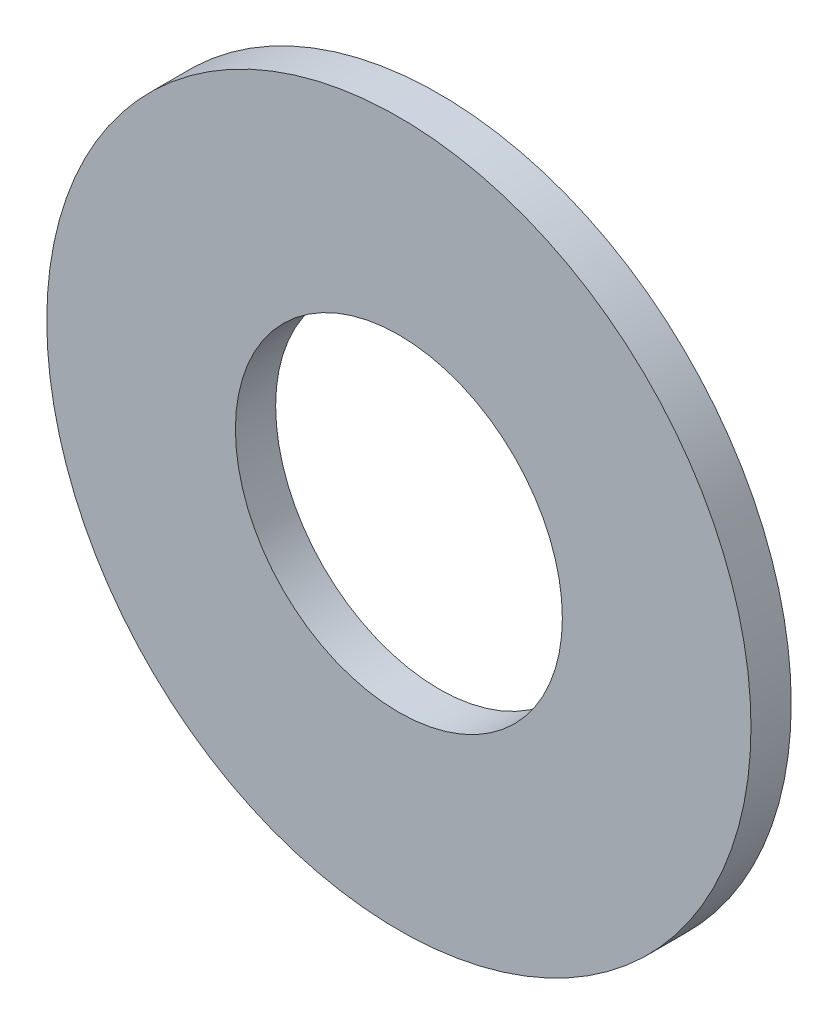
from build123d import *

# Parameters (mm, degrees)
SKETCH1_R      = 11.1125
SKETCH1_R_2    = 5.159375
EXTRUDE1_DEPTH = 1.27


with BuildPart() as part:
    # Sketch1 → Extrude1 (new body)
    with BuildSketch(Plane.XY):
        Circle(SKETCH1_R)
        Circle(SKETCH1_R_2, mode=Mode.SUBTRACT)
    extrude(amount=EXTRUDE1_DEPTH)


solid = part.part
